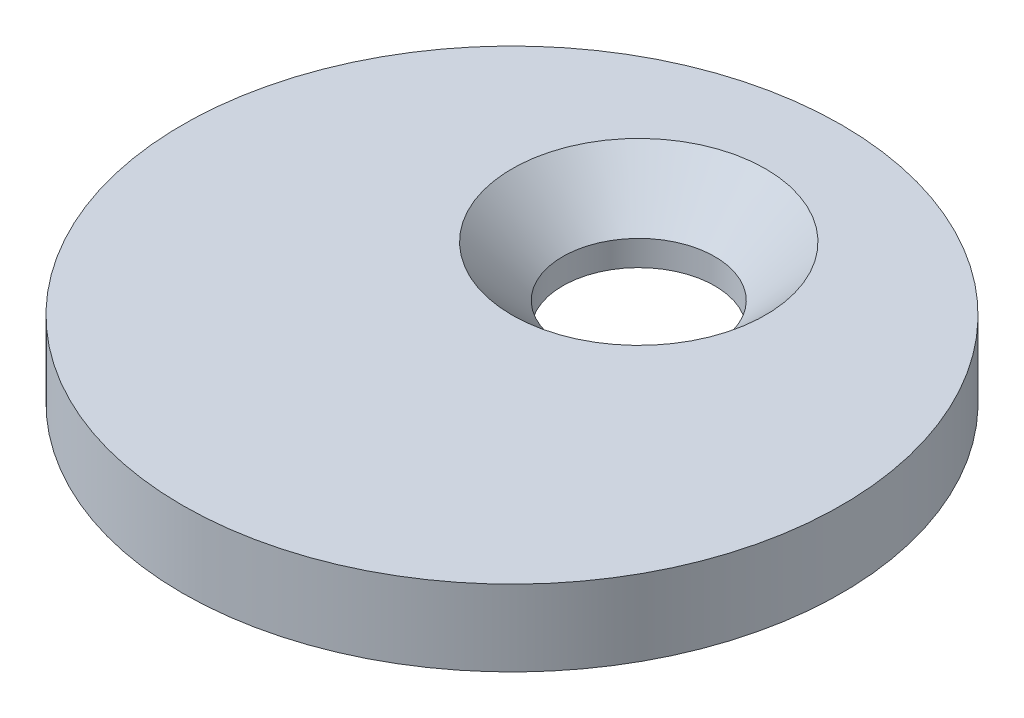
from build123d import *

# Parameters (mm, degrees)
SKETCH1_R      = 13
SKETCH1_R_2    = 3
EXTRUDE1_DEPTH = 3


with BuildPart() as part:
    # Sketch1 → Extrude1 (new body)
    with BuildSketch(Plane(origin=(0, 0, 0), x_dir=(1, 0, 0), z_dir=(0, 1, 0))):
        with Locations(Location((0, 0, 0), (0, 0, 270))):
            Circle(SKETCH1_R)
        with Locations(Location((0, 5, 0), (0, 0, 270))):
            Circle(SKETCH1_R_2, mode=Mode.SUBTRACT)
    extrude(amount=EXTRUDE1_DEPTH)

    # Sketch2 → CSK for M6 Countersunk Flat Head Screw1 (revolve, cut)
    with BuildSketch(Plane(origin=(0, 3, -5), x_dir=(0, 0, 1), z_dir=(1, 0, 0))):
        Polygon((0, 0), (0, 1.902581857), (3, 0.1), (3, 2), (5, 0), align=None)
    revolve(axis=Axis((0, 9.35, -5), (0, -1, 0)), mode=Mode.SUBTRACT)


solid = part.part
